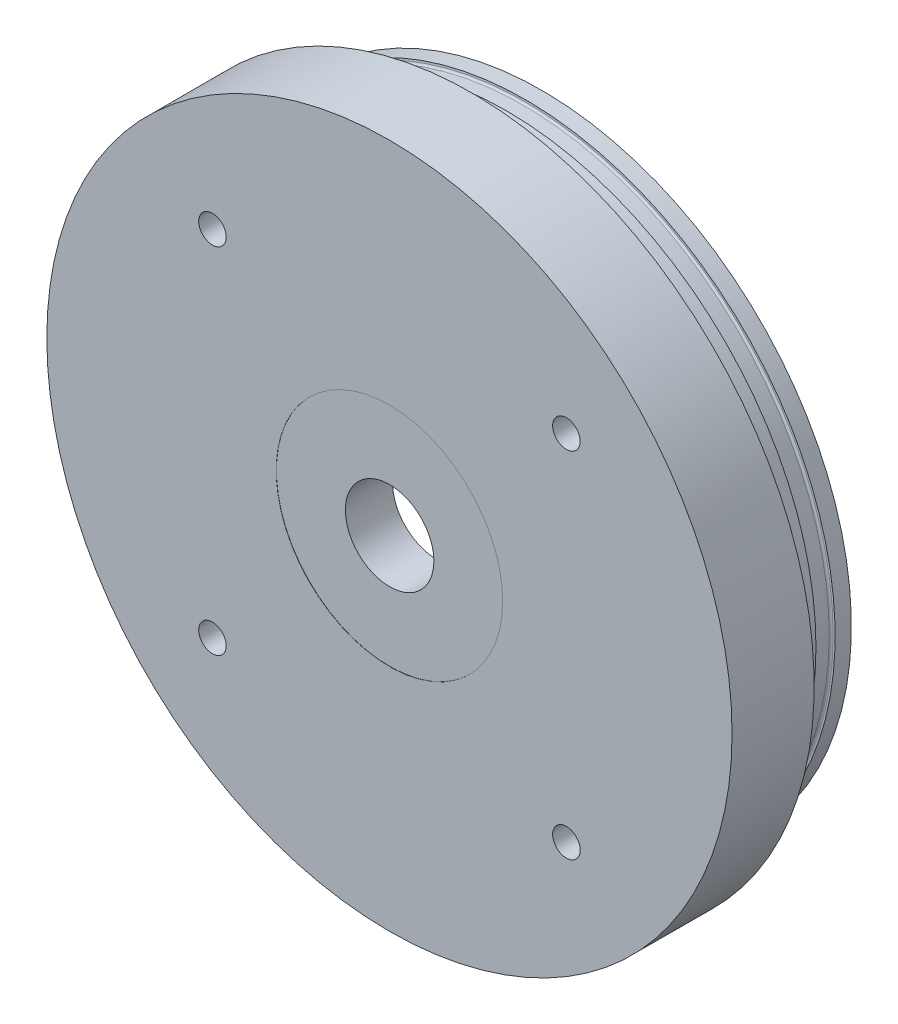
ISO-10303-21;
HEADER;
FILE_DESCRIPTION(('STEP AP214'),'2;1');
FILE_NAME('part.step','',(''),(''),'','','');
FILE_SCHEMA(('AUTOMOTIVE_DESIGN { 1 0 10303 214 1 1 1 1 }'));
ENDSEC;
DATA;
#1=APPLICATION_CONTEXT('core data for automotive mechanical design processes');
#2=APPLICATION_PROTOCOL_DEFINITION('international standard','automotive_design',2000,#1);
#3=PRODUCT_CONTEXT('',#1,'mechanical');
#4=PRODUCT('Part','Part','',(#3));
#5=PRODUCT_RELATED_PRODUCT_CATEGORY('part','',(#4));
#6=PRODUCT_DEFINITION_FORMATION('','',#4);
#7=PRODUCT_DEFINITION_CONTEXT('part definition',#1,'design');
#8=PRODUCT_DEFINITION('design','',#6,#7);
#9=PRODUCT_DEFINITION_SHAPE('','',#8);
#10=(LENGTH_UNIT() NAMED_UNIT(*) SI_UNIT(.MILLI.,.METRE.));
#11=(NAMED_UNIT(*) PLANE_ANGLE_UNIT() SI_UNIT($,.RADIAN.));
#12=(NAMED_UNIT(*) SI_UNIT($,.STERADIAN.) SOLID_ANGLE_UNIT());
#13=UNCERTAINTY_MEASURE_WITH_UNIT(LENGTH_MEASURE(1.E-05),#10,'distance_accuracy_value','');
#14=(GEOMETRIC_REPRESENTATION_CONTEXT(3) GLOBAL_UNCERTAINTY_ASSIGNED_CONTEXT((#13)) GLOBAL_UNIT_ASSIGNED_CONTEXT((#10,
#11,#12)) REPRESENTATION_CONTEXT('',''));
#15=CARTESIAN_POINT('',(0.,0.,0.));
#16=DIRECTION('',(0.,0.,1.));
#17=DIRECTION('',(1.,0.,0.));
#18=AXIS2_PLACEMENT_3D('',#15,#16,#17);
#19=CARTESIAN_POINT('',(0.,0.,8.8138));
#20=DIRECTION('',(0.,0.,-1.));
#21=DIRECTION('',(-1.,0.,0.));
#22=AXIS2_PLACEMENT_3D('',#19,#20,#21);
#23=PLANE('',#22);
#24=CARTESIAN_POINT('',(0.,0.,8.8138));
#25=DIRECTION('',(0.,0.,1.));
#26=DIRECTION('',(1.,0.,0.));
#27=AXIS2_PLACEMENT_3D('',#24,#25,#26);
#28=CIRCLE('',#27,40.005);
#29=CARTESIAN_POINT('',(40.005,0.,8.8138));
#30=VERTEX_POINT('',#29);
#31=EDGE_CURVE('E222',#30,#30,#28,.T.);
#32=ORIENTED_EDGE('',*,*,#31,.F.);
#33=EDGE_LOOP('',(#32));
#34=FACE_BOUND('',#33,.T.);
#35=CARTESIAN_POINT('',(0.,0.,8.8138));
#36=DIRECTION('',(0.,0.,-1.));
#37=DIRECTION('',(-1.,0.,0.));
#38=AXIS2_PLACEMENT_3D('',#35,#36,#37);
#39=CIRCLE('',#38,38.8874);
#40=CARTESIAN_POINT('',(-38.8874,0.,8.8138));
#41=VERTEX_POINT('',#40);
#42=EDGE_CURVE('E149',#41,#41,#39,.T.);
#43=ORIENTED_EDGE('',*,*,#42,.F.);
#44=EDGE_LOOP('',(#43));
#45=FACE_BOUND('',#44,.T.);
#46=ADVANCED_FACE('F36',(#34,#45),#23,.T.);
#47=CARTESIAN_POINT('',(0.,0.,8.8138));
#48=DIRECTION('',(0.,0.,-1.));
#49=DIRECTION('',(-1.,0.,0.));
#50=AXIS2_PLACEMENT_3D('',#47,#48,#49);
#51=CYLINDRICAL_SURFACE('',#50,38.8874);
#52=CARTESIAN_POINT('',(0.,0.,4.44647899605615));
#53=DIRECTION('',(0.,0.,1.));
#54=DIRECTION('',(1.,0.,0.));
#55=AXIS2_PLACEMENT_3D('',#52,#53,#54);
#56=CIRCLE('',#55,38.8874);
#57=CARTESIAN_POINT('',(38.8874,0.,4.44647899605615));
#58=VERTEX_POINT('',#57);
#59=EDGE_CURVE('E162',#58,#58,#56,.F.);
#60=ORIENTED_EDGE('',*,*,#59,.F.);
#61=EDGE_LOOP('',(#60));
#62=FACE_BOUND('',#61,.T.);
#63=ORIENTED_EDGE('',*,*,#42,.T.);
#64=EDGE_LOOP('',(#63));
#65=FACE_BOUND('',#64,.T.);
#66=ADVANCED_FACE('F177',(#62,#65),#51,.T.);
#67=CARTESIAN_POINT('',(0.,0.,2.3164868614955));
#68=DIRECTION('',(0.,0.,1.));
#69=DIRECTION('',(1.,0.,0.));
#70=AXIS2_PLACEMENT_3D('',#67,#68,#69);
#71=TOROIDAL_SURFACE('',#70,38.6715,0.253999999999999);
#72=CARTESIAN_POINT('',(0.,0.,2.3164868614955));
#73=DIRECTION('',(0.,0.,1.));
#74=DIRECTION('',(1.,0.,0.));
#75=AXIS2_PLACEMENT_3D('',#72,#73,#74);
#76=CIRCLE('',#75,38.4175);
#77=CARTESIAN_POINT('',(38.4175,0.,2.3164868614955));
#78=VERTEX_POINT('',#77);
#79=EDGE_CURVE('E235',#78,#78,#76,.T.);
#80=ORIENTED_EDGE('',*,*,#79,.F.);
#81=EDGE_LOOP('',(#80));
#82=FACE_BOUND('',#81,.T.);
#83=CARTESIAN_POINT('',(0.,0.,2.0634534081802));
#84=DIRECTION('',(0.,0.,1.));
#85=DIRECTION('',(1.,0.,0.));
#86=AXIS2_PLACEMENT_3D('',#83,#84,#85);
#87=CIRCLE('',#86,38.6493624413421);
#88=CARTESIAN_POINT('',(38.6493624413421,0.,2.0634534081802));
#89=VERTEX_POINT('',#88);
#90=EDGE_CURVE('E164',#89,#89,#87,.T.);
#91=ORIENTED_EDGE('',*,*,#90,.T.);
#92=EDGE_LOOP('',(#91));
#93=FACE_BOUND('',#92,.T.);
#94=ADVANCED_FACE('F199',(#82,#93),#71,.F.);
#95=CARTESIAN_POINT('',(0.,0.,1.9648503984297));
#96=DIRECTION('',(0.,0.,-1.));
#97=DIRECTION('',(-1.,0.,0.));
#98=AXIS2_PLACEMENT_3D('',#95,#96,#97);
#99=CONICAL_SURFACE('',#98,39.7764,1.48352986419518);
#100=CARTESIAN_POINT('',(0.,0.,2.04262782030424));
#101=DIRECTION('',(0.,0.,-1.));
#102=DIRECTION('',(-1.,0.,0.));
#103=AXIS2_PLACEMENT_3D('',#100,#101,#102);
#104=CIRCLE('',#103,38.8874);
#105=CARTESIAN_POINT('',(-38.8874,0.,2.04262782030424));
#106=VERTEX_POINT('',#105);
#107=EDGE_CURVE('E91',#106,#106,#104,.F.);
#108=ORIENTED_EDGE('',*,*,#107,.T.);
#109=EDGE_LOOP('',(#108));
#110=FACE_BOUND('',#109,.T.);
#111=ORIENTED_EDGE('',*,*,#90,.F.);
#112=EDGE_LOOP('',(#111));
#113=FACE_BOUND('',#112,.T.);
#114=ADVANCED_FACE('F168',(#110,#113),#99,.T.);
#115=CARTESIAN_POINT('',(0.,0.,4.4256534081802));
#116=DIRECTION('',(0.,0.,1.));
#117=DIRECTION('',(1.,0.,0.));
#118=AXIS2_PLACEMENT_3D('',#115,#116,#117);
#119=CONICAL_SURFACE('',#118,38.6493624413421,1.48352986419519);
#120=ORIENTED_EDGE('',*,*,#59,.T.);
#121=EDGE_LOOP('',(#120));
#122=FACE_BOUND('',#121,.T.);
#123=CARTESIAN_POINT('',(0.,0.,4.4256534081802));
#124=DIRECTION('',(0.,0.,1.));
#125=DIRECTION('',(1.,0.,0.));
#126=AXIS2_PLACEMENT_3D('',#123,#124,#125);
#127=CIRCLE('',#126,38.6493624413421);
#128=CARTESIAN_POINT('',(38.6493624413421,0.,4.4256534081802));
#129=VERTEX_POINT('',#128);
#130=EDGE_CURVE('E241',#129,#129,#127,.T.);
#131=ORIENTED_EDGE('',*,*,#130,.T.);
#132=EDGE_LOOP('',(#131));
#133=FACE_BOUND('',#132,.T.);
#134=ADVANCED_FACE('F247',(#122,#133),#119,.T.);
#135=CARTESIAN_POINT('',(0.,0.,4.17261995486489));
#136=DIRECTION('',(0.,0.,1.));
#137=DIRECTION('',(1.,0.,0.));
#138=AXIS2_PLACEMENT_3D('',#135,#136,#137);
#139=TOROIDAL_SURFACE('',#138,38.6715,0.253999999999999);
#140=ORIENTED_EDGE('',*,*,#130,.F.);
#141=EDGE_LOOP('',(#140));
#142=FACE_BOUND('',#141,.T.);
#143=CARTESIAN_POINT('',(0.,0.,4.17261995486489));
#144=DIRECTION('',(0.,0.,1.));
#145=DIRECTION('',(1.,0.,0.));
#146=AXIS2_PLACEMENT_3D('',#143,#144,#145);
#147=CIRCLE('',#146,38.4175);
#148=CARTESIAN_POINT('',(38.4175,0.,4.17261995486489));
#149=VERTEX_POINT('',#148);
#150=EDGE_CURVE('E238',#149,#149,#147,.T.);
#151=ORIENTED_EDGE('',*,*,#150,.T.);
#152=EDGE_LOOP('',(#151));
#153=FACE_BOUND('',#152,.T.);
#154=ADVANCED_FACE('F253',(#142,#153),#139,.F.);
#155=CARTESIAN_POINT('',(0.,0.,-41.1862));
#156=DIRECTION('',(0.,0.,1.));
#157=DIRECTION('',(1.,0.,0.));
#158=AXIS2_PLACEMENT_3D('',#155,#156,#157);
#159=CYLINDRICAL_SURFACE('',#158,38.4175);
#160=ORIENTED_EDGE('',*,*,#150,.F.);
#161=EDGE_LOOP('',(#160));
#162=FACE_BOUND('',#161,.T.);
#163=ORIENTED_EDGE('',*,*,#79,.T.);
#164=EDGE_LOOP('',(#163));
#165=FACE_BOUND('',#164,.T.);
#166=ADVANCED_FACE('F297',(#162,#165),#159,.T.);
#167=CARTESIAN_POINT('',(0.,0.,13.1826));
#168=DIRECTION('',(0.,0.,1.));
#169=DIRECTION('',(1.,0.,0.));
#170=AXIS2_PLACEMENT_3D('',#167,#168,#169);
#171=PLANE('',#170);
#172=CARTESIAN_POINT('',(0.,0.,13.1826));
#173=DIRECTION('',(0.,0.,1.));
#174=DIRECTION('',(1.,0.,0.));
#175=AXIS2_PLACEMENT_3D('',#172,#173,#174);
#176=CIRCLE('',#175,5.55624999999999);
#177=CARTESIAN_POINT('',(5.55624999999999,0.,13.1826));
#178=VERTEX_POINT('',#177);
#179=EDGE_CURVE('E637',#178,#178,#176,.T.);
#180=ORIENTED_EDGE('',*,*,#179,.T.);
#181=EDGE_LOOP('',(#180));
#182=FACE_BOUND('',#181,.T.);
#183=CARTESIAN_POINT('',(0.,0.,13.1826));
#184=DIRECTION('',(0.,0.,-1.));
#185=DIRECTION('',(-1.,0.,0.));
#186=AXIS2_PLACEMENT_3D('',#183,#184,#185);
#187=CIRCLE('',#186,14.1254292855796);
#188=CARTESIAN_POINT('',(-14.1254292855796,0.,13.1826));
#189=VERTEX_POINT('',#188);
#190=EDGE_CURVE('E115',#189,#189,#187,.T.);
#191=ORIENTED_EDGE('',*,*,#190,.T.);
#192=EDGE_LOOP('',(#191));
#193=FACE_BOUND('',#192,.T.);
#194=ADVANCED_FACE('F293',(#182,#193),#171,.F.);
#195=CARTESIAN_POINT('',(0.,32.639,11.43));
#196=DIRECTION('',(0.,0.,-1.));
#197=DIRECTION('',(-1.,0.,0.));
#198=AXIS2_PLACEMENT_3D('',#195,#196,#197);
#199=CONICAL_SURFACE('',#198,1.1303,1.02974425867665);
#200=CARTESIAN_POINT('',(0.,32.639,12.1091527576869));
#201=VERTEX_POINT('',#200);
#202=VERTEX_LOOP('',#201);
#203=FACE_BOUND('',#202,.T.);
#204=CARTESIAN_POINT('',(0.,32.639,11.43));
#205=DIRECTION('',(0.,0.,-1.));
#206=DIRECTION('',(-1.,0.,0.));
#207=AXIS2_PLACEMENT_3D('',#204,#205,#206);
#208=CIRCLE('',#207,1.1303);
#209=CARTESIAN_POINT('',(-1.1303,32.639,11.43));
#210=VERTEX_POINT('',#209);
#211=EDGE_CURVE('E45',#210,#210,#208,.T.);
#212=ORIENTED_EDGE('',*,*,#211,.T.);
#213=EDGE_LOOP('',(#212));
#214=FACE_BOUND('',#213,.T.);
#215=ADVANCED_FACE('F296',(#203,#214),#199,.F.);
#216=CARTESIAN_POINT('',(-12.7,-31.3038899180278,11.43));
#217=DIRECTION('',(0.,0.,-1.));
#218=DIRECTION('',(-1.,0.,0.));
#219=AXIS2_PLACEMENT_3D('',#216,#217,#218);
#220=CONICAL_SURFACE('',#219,1.13029999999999,1.02974425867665);
#221=CARTESIAN_POINT('',(-12.7,-31.3038899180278,12.1091527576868));
#222=VERTEX_POINT('',#221);
#223=VERTEX_LOOP('',#222);
#224=FACE_BOUND('',#223,.T.);
#225=CARTESIAN_POINT('',(-12.7,-31.3038899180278,11.43));
#226=DIRECTION('',(0.,0.,-1.));
#227=DIRECTION('',(-1.,0.,0.));
#228=AXIS2_PLACEMENT_3D('',#225,#226,#227);
#229=CIRCLE('',#228,1.13029999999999);
#230=CARTESIAN_POINT('',(-13.8303,-31.3038899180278,11.43));
#231=VERTEX_POINT('',#230);
#232=EDGE_CURVE('E139',#231,#231,#229,.T.);
#233=ORIENTED_EDGE('',*,*,#232,.T.);
#234=EDGE_LOOP('',(#233));
#235=FACE_BOUND('',#234,.T.);
#236=ADVANCED_FACE('F321',(#224,#235),#220,.F.);
#237=CARTESIAN_POINT('',(12.7,-31.3038899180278,11.43));
#238=DIRECTION('',(0.,0.,-1.));
#239=DIRECTION('',(-1.,0.,0.));
#240=AXIS2_PLACEMENT_3D('',#237,#238,#239);
#241=CONICAL_SURFACE('',#240,1.13029999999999,1.02974425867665);
#242=CARTESIAN_POINT('',(12.7,-31.3038899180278,12.1091527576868));
#243=VERTEX_POINT('',#242);
#244=VERTEX_LOOP('',#243);
#245=FACE_BOUND('',#244,.T.);
#246=CARTESIAN_POINT('',(12.7,-31.3038899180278,11.43));
#247=DIRECTION('',(0.,0.,-1.));
#248=DIRECTION('',(-1.,0.,0.));
#249=AXIS2_PLACEMENT_3D('',#246,#247,#248);
#250=CIRCLE('',#249,1.13029999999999);
#251=CARTESIAN_POINT('',(11.5697,-31.3038899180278,11.43));
#252=VERTEX_POINT('',#251);
#253=EDGE_CURVE('E133',#252,#252,#250,.T.);
#254=ORIENTED_EDGE('',*,*,#253,.T.);
#255=EDGE_LOOP('',(#254));
#256=FACE_BOUND('',#255,.T.);
#257=ADVANCED_FACE('F313',(#245,#256),#241,.F.);
#258=CARTESIAN_POINT('',(28.2662031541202,-16.3195000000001,11.43));
#259=DIRECTION('',(0.,0.,-1.));
#260=DIRECTION('',(-1.,0.,0.));
#261=AXIS2_PLACEMENT_3D('',#258,#259,#260);
#262=CONICAL_SURFACE('',#261,1.1303,1.02974425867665);
#263=CARTESIAN_POINT('',(28.2662031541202,-16.3195000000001,12.1091527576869));
#264=VERTEX_POINT('',#263);
#265=VERTEX_LOOP('',#264);
#266=FACE_BOUND('',#265,.T.);
#267=CARTESIAN_POINT('',(28.2662031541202,-16.3195000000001,11.43));
#268=DIRECTION('',(0.,0.,-1.));
#269=DIRECTION('',(-1.,0.,0.));
#270=AXIS2_PLACEMENT_3D('',#267,#268,#269);
#271=CIRCLE('',#270,1.1303);
#272=CARTESIAN_POINT('',(27.1359031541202,-16.3195000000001,11.43));
#273=VERTEX_POINT('',#272);
#274=EDGE_CURVE('E127',#273,#273,#271,.T.);
#275=ORIENTED_EDGE('',*,*,#274,.T.);
#276=EDGE_LOOP('',(#275));
#277=FACE_BOUND('',#276,.T.);
#278=ADVANCED_FACE('F305',(#266,#277),#262,.F.);
#279=CARTESIAN_POINT('',(-28.2662031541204,-16.3194999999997,11.43));
#280=DIRECTION('',(0.,0.,-1.));
#281=DIRECTION('',(-1.,0.,0.));
#282=AXIS2_PLACEMENT_3D('',#279,#280,#281);
#283=CONICAL_SURFACE('',#282,1.1303,1.02974425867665);
#284=CARTESIAN_POINT('',(-28.2662031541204,-16.3194999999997,12.1091527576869));
#285=VERTEX_POINT('',#284);
#286=VERTEX_LOOP('',#285);
#287=FACE_BOUND('',#286,.T.);
#288=CARTESIAN_POINT('',(-28.2662031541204,-16.3194999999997,11.43));
#289=DIRECTION('',(0.,0.,-1.));
#290=DIRECTION('',(-1.,0.,0.));
#291=AXIS2_PLACEMENT_3D('',#288,#289,#290);
#292=CIRCLE('',#291,1.1303);
#293=CARTESIAN_POINT('',(-29.3965031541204,-16.3194999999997,11.43));
#294=VERTEX_POINT('',#293);
#295=EDGE_CURVE('E121',#294,#294,#292,.T.);
#296=ORIENTED_EDGE('',*,*,#295,.T.);
#297=EDGE_LOOP('',(#296));
#298=FACE_BOUND('',#297,.T.);
#299=ADVANCED_FACE('F291',(#287,#298),#283,.F.);
#300=CARTESIAN_POINT('',(0.,0.,0.));
#301=DIRECTION('',(0.,0.,-1.));
#302=DIRECTION('',(-1.,0.,0.));
#303=AXIS2_PLACEMENT_3D('',#300,#301,#302);
#304=CYLINDRICAL_SURFACE('',#303,14.1254292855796);
#305=ORIENTED_EDGE('',*,*,#190,.F.);
#306=EDGE_LOOP('',(#305));
#307=FACE_BOUND('',#306,.T.);
#308=CARTESIAN_POINT('',(0.,0.,8.5852));
#309=DIRECTION('',(0.,0.,-1.));
#310=DIRECTION('',(-1.,0.,0.));
#311=AXIS2_PLACEMENT_3D('',#308,#309,#310);
#312=CIRCLE('',#311,14.1254292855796);
#313=CARTESIAN_POINT('',(-14.1254292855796,0.,8.5852));
#314=VERTEX_POINT('',#313);
#315=EDGE_CURVE('E112',#314,#314,#312,.T.);
#316=ORIENTED_EDGE('',*,*,#315,.T.);
#317=EDGE_LOOP('',(#316));
#318=FACE_BOUND('',#317,.T.);
#319=ADVANCED_FACE('F287',(#307,#318),#304,.F.);
#320=CARTESIAN_POINT('',(0.,32.639,0.));
#321=DIRECTION('',(0.,0.,-1.));
#322=DIRECTION('',(-1.,0.,0.));
#323=AXIS2_PLACEMENT_3D('',#320,#321,#322);
#324=CYLINDRICAL_SURFACE('',#323,1.1303);
#325=ORIENTED_EDGE('',*,*,#211,.F.);
#326=EDGE_LOOP('',(#325));
#327=FACE_BOUND('',#326,.T.);
#328=CARTESIAN_POINT('',(0.,32.639,0.));
#329=DIRECTION('',(0.,0.,-1.));
#330=DIRECTION('',(-1.,0.,0.));
#331=AXIS2_PLACEMENT_3D('',#328,#329,#330);
#332=CIRCLE('',#331,1.1303);
#333=CARTESIAN_POINT('',(-1.1303,32.639,0.));
#334=VERTEX_POINT('',#333);
#335=EDGE_CURVE('E155',#334,#334,#332,.T.);
#336=ORIENTED_EDGE('',*,*,#335,.T.);
#337=EDGE_LOOP('',(#336));
#338=FACE_BOUND('',#337,.T.);
#339=ADVANCED_FACE('F290',(#327,#338),#324,.F.);
#340=CARTESIAN_POINT('',(-12.7,-31.3038899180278,0.));
#341=DIRECTION('',(0.,0.,-1.));
#342=DIRECTION('',(-1.,0.,0.));
#343=AXIS2_PLACEMENT_3D('',#340,#341,#342);
#344=CYLINDRICAL_SURFACE('',#343,1.13029999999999);
#345=ORIENTED_EDGE('',*,*,#232,.F.);
#346=EDGE_LOOP('',(#345));
#347=FACE_BOUND('',#346,.T.);
#348=CARTESIAN_POINT('',(-12.7,-31.3038899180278,0.));
#349=DIRECTION('',(0.,0.,-1.));
#350=DIRECTION('',(-1.,0.,0.));
#351=AXIS2_PLACEMENT_3D('',#348,#349,#350);
#352=CIRCLE('',#351,1.13029999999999);
#353=CARTESIAN_POINT('',(-13.8303,-31.3038899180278,0.));
#354=VERTEX_POINT('',#353);
#355=EDGE_CURVE('E136',#354,#354,#352,.T.);
#356=ORIENTED_EDGE('',*,*,#355,.T.);
#357=EDGE_LOOP('',(#356));
#358=FACE_BOUND('',#357,.T.);
#359=ADVANCED_FACE('F317',(#347,#358),#344,.F.);
#360=CARTESIAN_POINT('',(12.7,-31.3038899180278,0.));
#361=DIRECTION('',(0.,0.,-1.));
#362=DIRECTION('',(-1.,0.,0.));
#363=AXIS2_PLACEMENT_3D('',#360,#361,#362);
#364=CYLINDRICAL_SURFACE('',#363,1.13029999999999);
#365=ORIENTED_EDGE('',*,*,#253,.F.);
#366=EDGE_LOOP('',(#365));
#367=FACE_BOUND('',#366,.T.);
#368=CARTESIAN_POINT('',(12.7,-31.3038899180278,0.));
#369=DIRECTION('',(0.,0.,-1.));
#370=DIRECTION('',(-1.,0.,0.));
#371=AXIS2_PLACEMENT_3D('',#368,#369,#370);
#372=CIRCLE('',#371,1.13029999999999);
#373=CARTESIAN_POINT('',(11.5697,-31.3038899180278,0.));
#374=VERTEX_POINT('',#373);
#375=EDGE_CURVE('E130',#374,#374,#372,.T.);
#376=ORIENTED_EDGE('',*,*,#375,.T.);
#377=EDGE_LOOP('',(#376));
#378=FACE_BOUND('',#377,.T.);
#379=ADVANCED_FACE('F309',(#367,#378),#364,.F.);
#380=CARTESIAN_POINT('',(28.2662031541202,-16.3195000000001,0.));
#381=DIRECTION('',(0.,0.,-1.));
#382=DIRECTION('',(-1.,0.,0.));
#383=AXIS2_PLACEMENT_3D('',#380,#381,#382);
#384=CYLINDRICAL_SURFACE('',#383,1.1303);
#385=ORIENTED_EDGE('',*,*,#274,.F.);
#386=EDGE_LOOP('',(#385));
#387=FACE_BOUND('',#386,.T.);
#388=CARTESIAN_POINT('',(28.2662031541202,-16.3195000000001,0.));
#389=DIRECTION('',(0.,0.,-1.));
#390=DIRECTION('',(-1.,0.,0.));
#391=AXIS2_PLACEMENT_3D('',#388,#389,#390);
#392=CIRCLE('',#391,1.1303);
#393=CARTESIAN_POINT('',(27.1359031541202,-16.3195000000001,0.));
#394=VERTEX_POINT('',#393);
#395=EDGE_CURVE('E124',#394,#394,#392,.T.);
#396=ORIENTED_EDGE('',*,*,#395,.T.);
#397=EDGE_LOOP('',(#396));
#398=FACE_BOUND('',#397,.T.);
#399=ADVANCED_FACE('F301',(#387,#398),#384,.F.);
#400=CARTESIAN_POINT('',(-28.2662031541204,-16.3194999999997,0.));
#401=DIRECTION('',(0.,0.,-1.));
#402=DIRECTION('',(-1.,0.,0.));
#403=AXIS2_PLACEMENT_3D('',#400,#401,#402);
#404=CYLINDRICAL_SURFACE('',#403,1.1303);
#405=ORIENTED_EDGE('',*,*,#295,.F.);
#406=EDGE_LOOP('',(#405));
#407=FACE_BOUND('',#406,.T.);
#408=CARTESIAN_POINT('',(-28.2662031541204,-16.3194999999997,0.));
#409=DIRECTION('',(0.,0.,-1.));
#410=DIRECTION('',(-1.,0.,0.));
#411=AXIS2_PLACEMENT_3D('',#408,#409,#410);
#412=CIRCLE('',#411,1.1303);
#413=CARTESIAN_POINT('',(-29.3965031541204,-16.3194999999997,0.));
#414=VERTEX_POINT('',#413);
#415=EDGE_CURVE('E118',#414,#414,#412,.T.);
#416=ORIENTED_EDGE('',*,*,#415,.T.);
#417=EDGE_LOOP('',(#416));
#418=FACE_BOUND('',#417,.T.);
#419=ADVANCED_FACE('F186',(#407,#418),#404,.F.);
#420=CARTESIAN_POINT('',(0.,0.,0.));
#421=DIRECTION('',(0.,0.,-1.));
#422=DIRECTION('',(-1.,0.,0.));
#423=AXIS2_PLACEMENT_3D('',#420,#421,#422);
#424=CONICAL_SURFACE('',#423,28.575,1.03469003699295);
#425=ORIENTED_EDGE('',*,*,#315,.F.);
#426=EDGE_LOOP('',(#425));
#427=FACE_BOUND('',#426,.T.);
#428=CARTESIAN_POINT('',(0.,0.,0.));
#429=DIRECTION('',(0.,0.,-1.));
#430=DIRECTION('',(-1.,0.,0.));
#431=AXIS2_PLACEMENT_3D('',#428,#429,#430);
#432=CIRCLE('',#431,28.575);
#433=CARTESIAN_POINT('',(-28.575,0.,0.));
#434=VERTEX_POINT('',#433);
#435=EDGE_CURVE('E109',#434,#434,#432,.T.);
#436=ORIENTED_EDGE('',*,*,#435,.T.);
#437=EDGE_LOOP('',(#436));
#438=FACE_BOUND('',#437,.T.);
#439=ADVANCED_FACE('F181',(#427,#438),#424,.F.);
#440=CARTESIAN_POINT('',(0.,0.,0.));
#441=DIRECTION('',(0.,0.,1.));
#442=DIRECTION('',(1.,0.,0.));
#443=AXIS2_PLACEMENT_3D('',#440,#441,#442);
#444=PLANE('',#443);
#445=ORIENTED_EDGE('',*,*,#435,.F.);
#446=EDGE_LOOP('',(#445));
#447=FACE_BOUND('',#446,.T.);
#448=ORIENTED_EDGE('',*,*,#415,.F.);
#449=EDGE_LOOP('',(#448));
#450=FACE_BOUND('',#449,.T.);
#451=ORIENTED_EDGE('',*,*,#395,.F.);
#452=EDGE_LOOP('',(#451));
#453=FACE_BOUND('',#452,.T.);
#454=ORIENTED_EDGE('',*,*,#375,.F.);
#455=EDGE_LOOP('',(#454));
#456=FACE_BOUND('',#455,.T.);
#457=ORIENTED_EDGE('',*,*,#355,.F.);
#458=EDGE_LOOP('',(#457));
#459=FACE_BOUND('',#458,.T.);
#460=ORIENTED_EDGE('',*,*,#335,.F.);
#461=EDGE_LOOP('',(#460));
#462=FACE_BOUND('',#461,.T.);
#463=CARTESIAN_POINT('',(0.,0.,0.));
#464=DIRECTION('',(0.,0.,-1.));
#465=DIRECTION('',(-1.,0.,0.));
#466=AXIS2_PLACEMENT_3D('',#463,#464,#465);
#467=CIRCLE('',#466,38.8874);
#468=CARTESIAN_POINT('',(-38.8874,0.,0.));
#469=VERTEX_POINT('',#468);
#470=EDGE_CURVE('E146',#469,#469,#467,.T.);
#471=ORIENTED_EDGE('',*,*,#470,.T.);
#472=EDGE_LOOP('',(#471));
#473=FACE_BOUND('',#472,.T.);
#474=ADVANCED_FACE('F175',(#447,#450,#453,#456,#459,#462,#473),#444,.F.);
#475=ORIENTED_EDGE('',*,*,#107,.F.);
#476=EDGE_LOOP('',(#475));
#477=FACE_BOUND('',#476,.T.);
#478=ORIENTED_EDGE('',*,*,#470,.F.);
#479=EDGE_LOOP('',(#478));
#480=FACE_BOUND('',#479,.T.);
#481=ADVANCED_FACE('F171',(#477,#480),#51,.T.);
#482=CARTESIAN_POINT('',(0.,0.,9.8806));
#483=DIRECTION('',(0.,0.,1.));
#484=DIRECTION('',(1.,0.,0.));
#485=AXIS2_PLACEMENT_3D('',#482,#483,#484);
#486=TOROIDAL_SURFACE('',#485,40.3533031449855,0.253999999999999);
#487=CARTESIAN_POINT('',(0.,0.,10.1346));
#488=DIRECTION('',(0.,0.,1.));
#489=DIRECTION('',(1.,0.,0.));
#490=AXIS2_PLACEMENT_3D('',#487,#488,#489);
#491=CIRCLE('',#490,40.3533031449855);
#492=CARTESIAN_POINT('',(40.3533031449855,0.,10.1346));
#493=VERTEX_POINT('',#492);
#494=EDGE_CURVE('E633',#493,#493,#491,.T.);
#495=ORIENTED_EDGE('',*,*,#494,.F.);
#496=EDGE_LOOP('',(#495));
#497=FACE_BOUND('',#496,.T.);
#498=CARTESIAN_POINT('',(0.,0.,9.90273755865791));
#499=DIRECTION('',(0.,0.,1.));
#500=DIRECTION('',(1.,0.,0.));
#501=AXIS2_PLACEMENT_3D('',#498,#499,#500);
#502=CIRCLE('',#501,40.1002696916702);
#503=CARTESIAN_POINT('',(40.1002696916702,0.,9.90273755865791));
#504=VERTEX_POINT('',#503);
#505=EDGE_CURVE('E226',#504,#504,#502,.T.);
#506=ORIENTED_EDGE('',*,*,#505,.T.);
#507=EDGE_LOOP('',(#506));
#508=FACE_BOUND('',#507,.T.);
#509=ADVANCED_FACE('F174',(#497,#508),#486,.F.);
#510=CARTESIAN_POINT('',(0.,0.,8.8138));
#511=DIRECTION('',(0.,0.,1.));
#512=DIRECTION('',(1.,0.,0.));
#513=AXIS2_PLACEMENT_3D('',#510,#511,#512);
#514=CONICAL_SURFACE('',#513,40.005,0.0872664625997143);
#515=ORIENTED_EDGE('',*,*,#505,.F.);
#516=EDGE_LOOP('',(#515));
#517=FACE_BOUND('',#516,.T.);
#518=ORIENTED_EDGE('',*,*,#31,.T.);
#519=EDGE_LOOP('',(#518));
#520=FACE_BOUND('',#519,.T.);
#521=ADVANCED_FACE('F596',(#517,#520),#514,.T.);
#522=CARTESIAN_POINT('',(0.,0.,10.0209168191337));
#523=DIRECTION('',(0.,0.,-1.));
#524=DIRECTION('',(-1.,0.,0.));
#525=AXIS2_PLACEMENT_3D('',#522,#523,#524);
#526=CONICAL_SURFACE('',#525,41.7954239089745,0.105049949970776);
#527=CARTESIAN_POINT('',(0.,0.,8.8138));
#528=DIRECTION('',(0.,0.,1.));
#529=DIRECTION('',(1.,0.,0.));
#530=AXIS2_PLACEMENT_3D('',#527,#528,#529);
#531=CIRCLE('',#530,41.9227);
#532=CARTESIAN_POINT('',(41.9227,0.,8.8138));
#533=VERTEX_POINT('',#532);
#534=EDGE_CURVE('E218',#533,#533,#531,.T.);
#535=ORIENTED_EDGE('',*,*,#534,.F.);
#536=EDGE_LOOP('',(#535));
#537=FACE_BOUND('',#536,.T.);
#538=CARTESIAN_POINT('',(0.,0.,10.0209168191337));
#539=DIRECTION('',(0.,0.,1.));
#540=DIRECTION('',(1.,0.,0.));
#541=AXIS2_PLACEMENT_3D('',#538,#539,#540);
#542=CIRCLE('',#541,41.7954239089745);
#543=CARTESIAN_POINT('',(41.7954239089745,0.,10.0209168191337));
#544=VERTEX_POINT('',#543);
#545=EDGE_CURVE('E223',#544,#544,#542,.T.);
#546=ORIENTED_EDGE('',*,*,#545,.T.);
#547=EDGE_LOOP('',(#546));
#548=FACE_BOUND('',#547,.T.);
#549=ADVANCED_FACE('F586',(#537,#548),#526,.F.);
#550=CARTESIAN_POINT('',(0.,0.,10.0076));
#551=DIRECTION('',(0.,0.,1.));
#552=DIRECTION('',(1.,0.,0.));
#553=AXIS2_PLACEMENT_3D('',#550,#551,#552);
#554=TOROIDAL_SURFACE('',#553,41.6691240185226,0.127000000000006);
#555=ORIENTED_EDGE('',*,*,#545,.F.);
#556=EDGE_LOOP('',(#555));
#557=FACE_BOUND('',#556,.T.);
#558=CARTESIAN_POINT('',(0.,0.,10.1346));
#559=DIRECTION('',(0.,0.,1.));
#560=DIRECTION('',(1.,0.,0.));
#561=AXIS2_PLACEMENT_3D('',#558,#559,#560);
#562=CIRCLE('',#561,41.6691240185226);
#563=CARTESIAN_POINT('',(41.6691240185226,0.,10.1346));
#564=VERTEX_POINT('',#563);
#565=EDGE_CURVE('E229',#564,#564,#562,.T.);
#566=ORIENTED_EDGE('',*,*,#565,.T.);
#567=EDGE_LOOP('',(#566));
#568=FACE_BOUND('',#567,.T.);
#569=ADVANCED_FACE('F575',(#557,#568),#554,.F.);
#570=CARTESIAN_POINT('',(0.,41.6691240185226,10.1346));
#571=DIRECTION('',(0.,0.,1.));
#572=DIRECTION('',(1.,0.,0.));
#573=AXIS2_PLACEMENT_3D('',#570,#571,#572);
#574=PLANE('',#573);
#575=ORIENTED_EDGE('',*,*,#565,.F.);
#576=EDGE_LOOP('',(#575));
#577=FACE_BOUND('',#576,.T.);
#578=ORIENTED_EDGE('',*,*,#494,.T.);
#579=EDGE_LOOP('',(#578));
#580=FACE_BOUND('',#579,.T.);
#581=ADVANCED_FACE('F330',(#577,#580),#574,.F.);
#582=CARTESIAN_POINT('',(0.,0.,19.1008));
#583=DIRECTION('',(0.,0.,1.));
#584=DIRECTION('',(1.,0.,0.));
#585=AXIS2_PLACEMENT_3D('',#582,#583,#584);
#586=PLANE('',#585);
#587=CARTESIAN_POINT('',(0.,0.,19.1008));
#588=DIRECTION('',(0.,0.,1.));
#589=DIRECTION('',(1.,0.,0.));
#590=AXIS2_PLACEMENT_3D('',#587,#588,#589);
#591=CIRCLE('',#590,5.55624999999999);
#592=CARTESIAN_POINT('',(5.55624999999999,0.,19.1008));
#593=VERTEX_POINT('',#592);
#594=EDGE_CURVE('E40',#593,#593,#591,.T.);
#595=ORIENTED_EDGE('',*,*,#594,.F.);
#596=EDGE_LOOP('',(#595));
#597=FACE_BOUND('',#596,.T.);
#598=CARTESIAN_POINT('',(0.,0.,19.1008));
#599=DIRECTION('',(0.,0.,1.));
#600=DIRECTION('',(1.,0.,0.));
#601=AXIS2_PLACEMENT_3D('',#598,#599,#600);
#602=CIRCLE('',#601,14.224);
#603=CARTESIAN_POINT('',(14.224,0.,19.1008));
#604=VERTEX_POINT('',#603);
#605=EDGE_CURVE('E143',#604,#604,#602,.T.);
#606=ORIENTED_EDGE('',*,*,#605,.T.);
#607=EDGE_LOOP('',(#606));
#608=FACE_BOUND('',#607,.T.);
#609=ADVANCED_FACE('F284',(#597,#608),#586,.T.);
#610=CARTESIAN_POINT('',(22.2250145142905,-22.2250145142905,6.6802));
#611=DIRECTION('',(0.,0.,1.));
#612=DIRECTION('',(1.,0.,0.));
#613=AXIS2_PLACEMENT_3D('',#610,#611,#612);
#614=CONICAL_SURFACE('',#613,1.7272,1.02974425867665);
#615=CARTESIAN_POINT('',(22.2250145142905,-22.2250145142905,5.64239353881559));
#616=VERTEX_POINT('',#615);
#617=VERTEX_LOOP('',#616);
#618=FACE_BOUND('',#617,.T.);
#619=CARTESIAN_POINT('',(22.2250145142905,-22.2250145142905,6.6802));
#620=DIRECTION('',(0.,0.,1.));
#621=DIRECTION('',(1.,0.,0.));
#622=AXIS2_PLACEMENT_3D('',#619,#620,#621);
#623=CIRCLE('',#622,1.7272);
#624=CARTESIAN_POINT('',(23.9522145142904,-22.2250145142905,6.6802));
#625=VERTEX_POINT('',#624);
#626=EDGE_CURVE('E106',#625,#625,#623,.T.);
#627=ORIENTED_EDGE('',*,*,#626,.T.);
#628=EDGE_LOOP('',(#627));
#629=FACE_BOUND('',#628,.T.);
#630=ADVANCED_FACE('F278',(#618,#629),#614,.F.);
#631=CARTESIAN_POINT('',(-22.2249854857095,-22.2250145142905,6.6802));
#632=DIRECTION('',(0.,0.,1.));
#633=DIRECTION('',(1.,0.,0.));
#634=AXIS2_PLACEMENT_3D('',#631,#632,#633);
#635=CONICAL_SURFACE('',#634,1.7272,1.02974425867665);
#636=CARTESIAN_POINT('',(-22.2249854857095,-22.2250145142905,5.64239353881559));
#637=VERTEX_POINT('',#636);
#638=VERTEX_LOOP('',#637);
#639=FACE_BOUND('',#638,.T.);
#640=CARTESIAN_POINT('',(-22.2249854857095,-22.2250145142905,6.6802));
#641=DIRECTION('',(0.,0.,1.));
#642=DIRECTION('',(1.,0.,0.));
#643=AXIS2_PLACEMENT_3D('',#640,#641,#642);
#644=CIRCLE('',#643,1.7272);
#645=CARTESIAN_POINT('',(-20.4977854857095,-22.2250145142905,6.6802));
#646=VERTEX_POINT('',#645);
#647=EDGE_CURVE('E100',#646,#646,#644,.T.);
#648=ORIENTED_EDGE('',*,*,#647,.T.);
#649=EDGE_LOOP('',(#648));
#650=FACE_BOUND('',#649,.T.);
#651=ADVANCED_FACE('F270',(#639,#650),#635,.F.);
#652=CARTESIAN_POINT('',(22.2250145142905,22.2249854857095,6.6802));
#653=DIRECTION('',(0.,0.,1.));
#654=DIRECTION('',(1.,0.,0.));
#655=AXIS2_PLACEMENT_3D('',#652,#653,#654);
#656=CONICAL_SURFACE('',#655,1.7272,1.02974425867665);
#657=CARTESIAN_POINT('',(22.2250145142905,22.2249854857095,5.64239353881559));
#658=VERTEX_POINT('',#657);
#659=VERTEX_LOOP('',#658);
#660=FACE_BOUND('',#659,.T.);
#661=CARTESIAN_POINT('',(22.2250145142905,22.2249854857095,6.6802));
#662=DIRECTION('',(0.,0.,1.));
#663=DIRECTION('',(1.,0.,0.));
#664=AXIS2_PLACEMENT_3D('',#661,#662,#663);
#665=CIRCLE('',#664,1.7272);
#666=CARTESIAN_POINT('',(23.9522145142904,22.2249854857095,6.6802));
#667=VERTEX_POINT('',#666);
#668=EDGE_CURVE('E88',#667,#667,#665,.T.);
#669=ORIENTED_EDGE('',*,*,#668,.T.);
#670=EDGE_LOOP('',(#669));
#671=FACE_BOUND('',#670,.T.);
#672=ADVANCED_FACE('F78',(#660,#671),#656,.F.);
#673=CARTESIAN_POINT('',(-22.2249854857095,22.2249854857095,6.6802));
#674=DIRECTION('',(0.,0.,1.));
#675=DIRECTION('',(1.,0.,0.));
#676=AXIS2_PLACEMENT_3D('',#673,#674,#675);
#677=CONICAL_SURFACE('',#676,1.7272,1.02974425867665);
#678=CARTESIAN_POINT('',(-22.2249854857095,22.2249854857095,5.64239353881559));
#679=VERTEX_POINT('',#678);
#680=VERTEX_LOOP('',#679);
#681=FACE_BOUND('',#680,.T.);
#682=CARTESIAN_POINT('',(-22.2249854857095,22.2249854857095,6.6802));
#683=DIRECTION('',(0.,0.,1.));
#684=DIRECTION('',(1.,0.,0.));
#685=AXIS2_PLACEMENT_3D('',#682,#683,#684);
#686=CIRCLE('',#685,1.7272);
#687=CARTESIAN_POINT('',(-20.4977854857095,22.2249854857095,6.6802));
#688=VERTEX_POINT('',#687);
#689=EDGE_CURVE('E82',#688,#688,#686,.T.);
#690=ORIENTED_EDGE('',*,*,#689,.T.);
#691=EDGE_LOOP('',(#690));
#692=FACE_BOUND('',#691,.T.);
#693=ADVANCED_FACE('F74',(#681,#692),#677,.F.);
#694=CARTESIAN_POINT('',(0.,0.,19.1008));
#695=DIRECTION('',(0.,0.,1.));
#696=DIRECTION('',(1.,0.,0.));
#697=AXIS2_PLACEMENT_3D('',#694,#695,#696);
#698=CYLINDRICAL_SURFACE('',#697,14.224);
#699=ORIENTED_EDGE('',*,*,#605,.F.);
#700=EDGE_LOOP('',(#699));
#701=FACE_BOUND('',#700,.T.);
#702=CARTESIAN_POINT('',(0.,0.,19.1262));
#703=DIRECTION('',(0.,0.,1.));
#704=DIRECTION('',(1.,0.,0.));
#705=AXIS2_PLACEMENT_3D('',#702,#703,#704);
#706=CIRCLE('',#705,14.224);
#707=CARTESIAN_POINT('',(14.224,0.,19.1262));
#708=VERTEX_POINT('',#707);
#709=EDGE_CURVE('E142',#708,#708,#706,.T.);
#710=ORIENTED_EDGE('',*,*,#709,.T.);
#711=EDGE_LOOP('',(#710));
#712=FACE_BOUND('',#711,.T.);
#713=ADVANCED_FACE('F77',(#701,#712),#698,.F.);
#714=CARTESIAN_POINT('',(22.2250145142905,-22.2250145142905,19.1262));
#715=DIRECTION('',(0.,0.,1.));
#716=DIRECTION('',(1.,0.,0.));
#717=AXIS2_PLACEMENT_3D('',#714,#715,#716);
#718=CYLINDRICAL_SURFACE('',#717,1.7272);
#719=ORIENTED_EDGE('',*,*,#626,.F.);
#720=EDGE_LOOP('',(#719));
#721=FACE_BOUND('',#720,.T.);
#722=CARTESIAN_POINT('',(22.2250145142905,-22.2250145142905,19.1262));
#723=DIRECTION('',(0.,0.,1.));
#724=DIRECTION('',(1.,0.,0.));
#725=AXIS2_PLACEMENT_3D('',#722,#723,#724);
#726=CIRCLE('',#725,1.7272);
#727=CARTESIAN_POINT('',(23.9522145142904,-22.2250145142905,19.1262));
#728=VERTEX_POINT('',#727);
#729=EDGE_CURVE('E103',#728,#728,#726,.T.);
#730=ORIENTED_EDGE('',*,*,#729,.T.);
#731=EDGE_LOOP('',(#730));
#732=FACE_BOUND('',#731,.T.);
#733=ADVANCED_FACE('F274',(#721,#732),#718,.F.);
#734=CARTESIAN_POINT('',(-22.2249854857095,-22.2250145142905,19.1262));
#735=DIRECTION('',(0.,0.,1.));
#736=DIRECTION('',(1.,0.,0.));
#737=AXIS2_PLACEMENT_3D('',#734,#735,#736);
#738=CYLINDRICAL_SURFACE('',#737,1.7272);
#739=ORIENTED_EDGE('',*,*,#647,.F.);
#740=EDGE_LOOP('',(#739));
#741=FACE_BOUND('',#740,.T.);
#742=CARTESIAN_POINT('',(-22.2249854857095,-22.2250145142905,19.1262));
#743=DIRECTION('',(0.,0.,1.));
#744=DIRECTION('',(1.,0.,0.));
#745=AXIS2_PLACEMENT_3D('',#742,#743,#744);
#746=CIRCLE('',#745,1.7272);
#747=CARTESIAN_POINT('',(-20.4977854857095,-22.2250145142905,19.1262));
#748=VERTEX_POINT('',#747);
#749=EDGE_CURVE('E97',#748,#748,#746,.T.);
#750=ORIENTED_EDGE('',*,*,#749,.T.);
#751=EDGE_LOOP('',(#750));
#752=FACE_BOUND('',#751,.T.);
#753=ADVANCED_FACE('F266',(#741,#752),#738,.F.);
#754=CARTESIAN_POINT('',(22.2250145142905,22.2249854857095,19.1262));
#755=DIRECTION('',(0.,0.,1.));
#756=DIRECTION('',(1.,0.,0.));
#757=AXIS2_PLACEMENT_3D('',#754,#755,#756);
#758=CYLINDRICAL_SURFACE('',#757,1.7272);
#759=ORIENTED_EDGE('',*,*,#668,.F.);
#760=EDGE_LOOP('',(#759));
#761=FACE_BOUND('',#760,.T.);
#762=CARTESIAN_POINT('',(22.2250145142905,22.2249854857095,19.1262));
#763=DIRECTION('',(0.,0.,1.));
#764=DIRECTION('',(1.,0.,0.));
#765=AXIS2_PLACEMENT_3D('',#762,#763,#764);
#766=CIRCLE('',#765,1.7272);
#767=CARTESIAN_POINT('',(23.9522145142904,22.2249854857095,19.1262));
#768=VERTEX_POINT('',#767);
#769=EDGE_CURVE('E84',#768,#768,#766,.T.);
#770=ORIENTED_EDGE('',*,*,#769,.T.);
#771=EDGE_LOOP('',(#770));
#772=FACE_BOUND('',#771,.T.);
#773=ADVANCED_FACE('F262',(#761,#772),#758,.F.);
#774=CARTESIAN_POINT('',(-22.2249854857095,22.2249854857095,19.1262));
#775=DIRECTION('',(0.,0.,1.));
#776=DIRECTION('',(1.,0.,0.));
#777=AXIS2_PLACEMENT_3D('',#774,#775,#776);
#778=CYLINDRICAL_SURFACE('',#777,1.7272);
#779=ORIENTED_EDGE('',*,*,#689,.F.);
#780=EDGE_LOOP('',(#779));
#781=FACE_BOUND('',#780,.T.);
#782=CARTESIAN_POINT('',(-22.2249854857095,22.2249854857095,19.1262));
#783=DIRECTION('',(0.,0.,1.));
#784=DIRECTION('',(1.,0.,0.));
#785=AXIS2_PLACEMENT_3D('',#782,#783,#784);
#786=CIRCLE('',#785,1.7272);
#787=CARTESIAN_POINT('',(-20.4977854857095,22.2249854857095,19.1262));
#788=VERTEX_POINT('',#787);
#789=EDGE_CURVE('E85',#788,#788,#786,.T.);
#790=ORIENTED_EDGE('',*,*,#789,.T.);
#791=EDGE_LOOP('',(#790));
#792=FACE_BOUND('',#791,.T.);
#793=ADVANCED_FACE('F260',(#781,#792),#778,.F.);
#794=CARTESIAN_POINT('',(0.,0.,19.1262));
#795=DIRECTION('',(0.,0.,1.));
#796=DIRECTION('',(1.,0.,0.));
#797=AXIS2_PLACEMENT_3D('',#794,#795,#796);
#798=PLANE('',#797);
#799=ORIENTED_EDGE('',*,*,#789,.F.);
#800=EDGE_LOOP('',(#799));
#801=FACE_BOUND('',#800,.T.);
#802=ORIENTED_EDGE('',*,*,#769,.F.);
#803=EDGE_LOOP('',(#802));
#804=FACE_BOUND('',#803,.T.);
#805=ORIENTED_EDGE('',*,*,#749,.F.);
#806=EDGE_LOOP('',(#805));
#807=FACE_BOUND('',#806,.T.);
#808=ORIENTED_EDGE('',*,*,#729,.F.);
#809=EDGE_LOOP('',(#808));
#810=FACE_BOUND('',#809,.T.);
#811=ORIENTED_EDGE('',*,*,#709,.F.);
#812=EDGE_LOOP('',(#811));
#813=FACE_BOUND('',#812,.T.);
#814=CARTESIAN_POINT('',(0.,0.,19.1262));
#815=DIRECTION('',(0.,0.,1.));
#816=DIRECTION('',(1.,0.,0.));
#817=AXIS2_PLACEMENT_3D('',#814,#815,#816);
#818=CIRCLE('',#817,43.0276);
#819=CARTESIAN_POINT('',(43.0276,0.,19.1262));
#820=VERTEX_POINT('',#819);
#821=EDGE_CURVE('E11',#820,#820,#818,.T.);
#822=ORIENTED_EDGE('',*,*,#821,.T.);
#823=EDGE_LOOP('',(#822));
#824=FACE_BOUND('',#823,.T.);
#825=ADVANCED_FACE('F213',(#801,#804,#807,#810,#813,#824),#798,.T.);
#826=CARTESIAN_POINT('',(0.,0.,19.1262));
#827=DIRECTION('',(0.,0.,-1.));
#828=DIRECTION('',(-1.,0.,0.));
#829=AXIS2_PLACEMENT_3D('',#826,#827,#828);
#830=CYLINDRICAL_SURFACE('',#829,43.0276);
#831=ORIENTED_EDGE('',*,*,#821,.F.);
#832=EDGE_LOOP('',(#831));
#833=FACE_BOUND('',#832,.T.);
#834=CARTESIAN_POINT('',(0.,0.,8.8138));
#835=DIRECTION('',(0.,0.,-1.));
#836=DIRECTION('',(-1.,0.,0.));
#837=AXIS2_PLACEMENT_3D('',#834,#835,#836);
#838=CIRCLE('',#837,43.0276);
#839=CARTESIAN_POINT('',(-43.0276,0.,8.8138));
#840=VERTEX_POINT('',#839);
#841=EDGE_CURVE('E152',#840,#840,#838,.T.);
#842=ORIENTED_EDGE('',*,*,#841,.F.);
#843=EDGE_LOOP('',(#842));
#844=FACE_BOUND('',#843,.T.);
#845=ADVANCED_FACE('F38',(#833,#844),#830,.T.);
#846=ORIENTED_EDGE('',*,*,#534,.T.);
#847=EDGE_LOOP('',(#846));
#848=FACE_BOUND('',#847,.T.);
#849=ORIENTED_EDGE('',*,*,#841,.T.);
#850=EDGE_LOOP('',(#849));
#851=FACE_BOUND('',#850,.T.);
#852=ADVANCED_FACE('F195',(#848,#851),#23,.T.);
#853=CARTESIAN_POINT('',(0.,0.,19.1262));
#854=DIRECTION('',(0.,0.,1.));
#855=DIRECTION('',(1.,0.,0.));
#856=AXIS2_PLACEMENT_3D('',#853,#854,#855);
#857=CYLINDRICAL_SURFACE('',#856,5.55624999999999);
#858=ORIENTED_EDGE('',*,*,#594,.T.);
#859=EDGE_LOOP('',(#858));
#860=FACE_BOUND('',#859,.T.);
#861=ORIENTED_EDGE('',*,*,#179,.F.);
#862=EDGE_LOOP('',(#861));
#863=FACE_BOUND('',#862,.T.);
#864=ADVANCED_FACE('F205',(#860,#863),#857,.F.);
#865=CLOSED_SHELL('',(#46,#66,#94,#114,#134,#154,#166,#194,#215,#236,#257,#278,#299,#319,#339,
#359,#379,#399,#419,#439,#474,#481,#509,#521,#549,#569,#581,#609,#630,#651,#672,#693,#713,#733,
#753,#773,#793,#825,#845,#852,#864));
#866=MANIFOLD_SOLID_BREP('B2',#865);
#867=ADVANCED_BREP_SHAPE_REPRESENTATION('',(#18,#866),#14);
#868=SHAPE_DEFINITION_REPRESENTATION(#9,#867);
ENDSEC;
END-ISO-10303-21;
